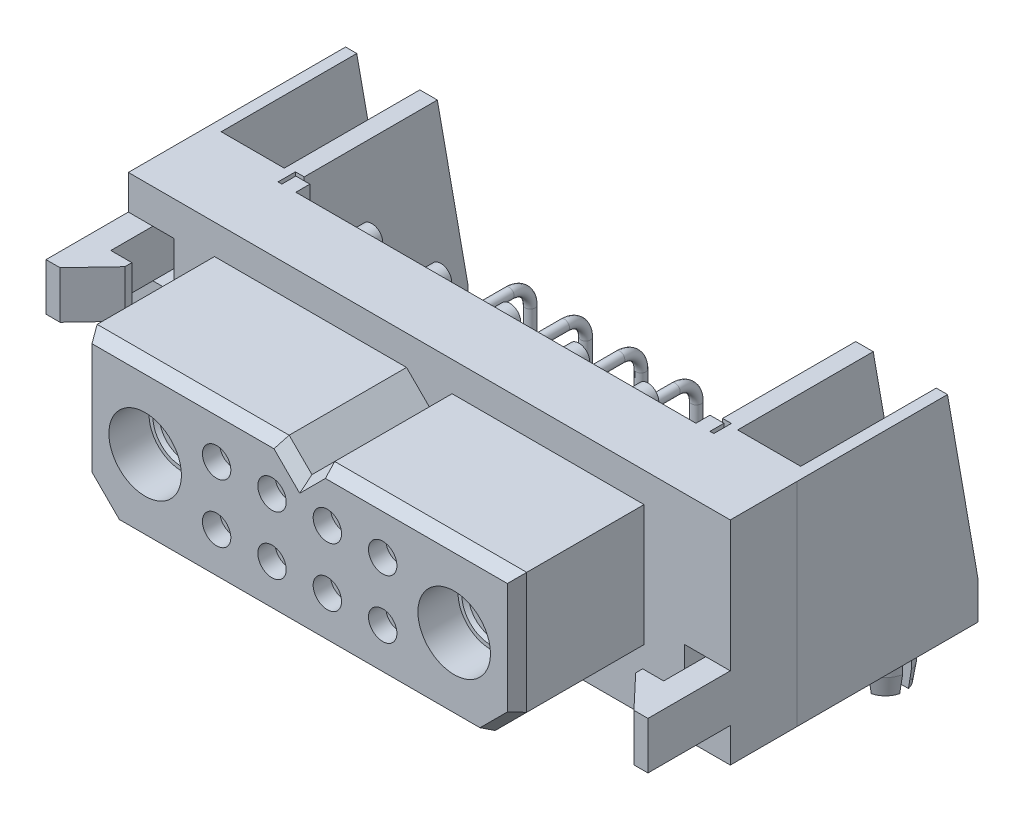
from build123d import *
from OCP.BRepFilletAPI import BRepFilletAPI_MakeChamfer

# Parameters (mm, degrees)
EXTRUDE1_DEPTH              = 15.3924
EXTRUDE2_DEPTH              = 9.398
CHAMFER1_SIZE               = 0.889
CHAMFER1_SIZE2              = 0.513264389
SKETCH4_W                   = 3.302
SKETCH4_H                   = 3.429
EXTRUDE3_DEPTH              = 5.969
SKETCH6_W                   = 1.524
SKETCH6_H                   = 3.048
CUT_EXTRUDE1_DEPTH          = 28.034538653
SKETCH7_W                   = 1.524
SKETCH7_H                   = 3.429
CUT_EXTRUDE2_DEPTH          = 4.826
SKETCH8_R                   = 0.7874
SKETCH8_W                   = 1.016
SKETCH8_H                   = 15.3924
EXTRUDE4_DEPTH              = 1.016
SKETCH9_R                   = 1.0287
CUT_EXTRUDE3_DEPTH          = 1.7272
SKETCH11_R                  = 0.89535
CUT_EXTRUDE4_DEPTH          = 1.397
LPATTERN2_COUNT             = 4
LPATTERN2_PITCH             = 4.0132
LPATTERN2_COUNT_DIR2        = 2
LPATTERN2_PITCH_DIR2        = 4.2418
CUT_EXTRUDE6_DEPTH          = 0.381
LPATTERN3_COUNT             = 4
LPATTERN3_PITCH             = 4.0132
LPATTERN3_COUNT_DIR2        = 2
LPATTERN3_PITCH_DIR2        = 4.2418
SKETCH15_R                  = 2.6289
CUT_EXTRUDE7_DEPTH          = 2.9718
EXTRUDE5_DEPTH              = 15.3923746
SKETCH18_W                  = 4.5719746
SKETCH18_H                  = 12.6745746
CUT_EXTRUDE8_DEPTH          = 12.0396
CUT_EXTRUDE9_DEPTH          = 0.508
SKETCH22_R                  = 2.6924
CUT_EXTRUDE10_DEPTH         = 0.9398
CUT_EXTRUDE11_DEPTH         = 3.4036
CUT_EXTRUDE12_DEPTH         = 44.898820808
EXTRUDE6_REACH              = 45.899
SKETCH26_W                  = 9.2964
SKETCH26_H                  = 1.524
SKETCH27_R                  = 3.175
CUT_EXTRUDE13_DEPTH         = 1.2192
SKETCH28_R                  = 2.7813
EXTRUDE7_DEPTH              = 0.4572
SKETCH29_R                  = 1.5875
CHAMFER2_SIZE               = 0.5588
LPATTERN4_COUNT             = 2
LPATTERN4_PITCH             = 22.4028
CHAMFER2_OF_LPATTERN4_SIZE  = 0.5588
SKETCH31_R                  = 0.3556
CHAMFER3_SIZE               = 0.762
CHAMFER3_SIZE2              = 0.204177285
SKETCH33_R                  = 0.3556
CHAMFER4_SIZE               = 0.762
CHAMFER4_SIZE2              = 0.204177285
LPATTERN5_COUNT             = 4
LPATTERN5_PITCH             = 4.0132
CHAMFER3_OF_LPATTERN5_SIZE2 = 0.204177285
CHAMFER3_OF_LPATTERN5_SIZE  = 0.762
CHAMFER4_OF_LPATTERN5_SIZE2 = 0.204177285
CHAMFER4_OF_LPATTERN5_SIZE  = 0.762


with BuildPart() as part:
    # Sketch2 → Extrude1 (new body)
    with BuildSketch(Plane(origin=(0, 0, 0), x_dir=(1, 0, 0), z_dir=(0, 1, 0))):
        Polygon((-21.8186, 0), (21.8186, 0), (21.8186, 4.826), (-15.5194, 4.826), (-21.8186, 4.826), align=None)
    extrude(amount=EXTRUDE1_DEPTH)

    # Sketch3 → Extrude2 (add)
    with BuildSketch(Plane.XY):
        Polygon((-13.2842, 2.159), (13.2842, 2.159), (15.5702, 4.445), (15.5702, 13.2334), (1.651, 13.2334), (0, 11.5824), (-1.651, 13.2334), (-15.5702, 13.2334), (-15.5702, 4.445), align=None)
    extrude(amount=EXTRUDE2_DEPTH)

    # Chamfer1: one chamfer whose edges measure the first distance from different faces: ONE call of the kernel's chamfer builder (chamfer() names one face for all edges)
    chamfer1_edges_1 = [part.edges().sort_by_distance(p)[0] for p in [
        (8.6106, 13.2334, 9.398),
    ]]
    chamfer1_side_1 = [part.faces().sort_by_distance(p)[0] for p in [
        (8.6106, 13.2334, 4.699),
    ]]
    chamfer1_edges_2 = [part.edges().sort_by_distance(p)[0] for p in [
        (0.8255, 12.4079, 9.398),
    ]]
    chamfer1_side_2 = [part.faces().sort_by_distance(p)[0] for p in [
        (0.8255, 12.4079, 4.699),
    ]]
    chamfer1_edges_3 = [part.edges().sort_by_distance(p)[0] for p in [
        (-0.8255, 12.4079, 9.398),
    ]]
    chamfer1_side_3 = [part.faces().sort_by_distance(p)[0] for p in [
        (-0.8255, 12.4079, 4.699),
    ]]
    chamfer1_edges_4 = [part.edges().sort_by_distance(p)[0] for p in [
        (-8.6106, 13.2334, 9.398),
    ]]
    chamfer1_side_4 = [part.faces().sort_by_distance(p)[0] for p in [
        (-8.6106, 13.2334, 4.699),
    ]]
    chamfer1_edges_5 = [part.edges().sort_by_distance(p)[0] for p in [
        (-15.5702, 8.8392, 9.398),
    ]]
    chamfer1_side_5 = [part.faces().sort_by_distance(p)[0] for p in [
        (-15.5702, 8.8392, 4.699),
    ]]
    chamfer1_edges_6 = [part.edges().sort_by_distance(p)[0] for p in [
        (-14.4272, 3.302, 9.398),
    ]]
    chamfer1_side_6 = [part.faces().sort_by_distance(p)[0] for p in [
        (-14.4272, 3.302, 4.699),
    ]]
    chamfer1_edges_7 = [part.edges().sort_by_distance(p)[0] for p in [
        (0, 2.159, 9.398),
    ]]
    chamfer1_side_7 = [part.faces().sort_by_distance(p)[0] for p in [
        (0, 2.159, 4.699),
    ]]
    chamfer1_edges_8 = [part.edges().sort_by_distance(p)[0] for p in [
        (14.4272, 3.302, 9.398),
    ]]
    chamfer1_side_8 = [part.faces().sort_by_distance(p)[0] for p in [
        (14.4272, 3.302, 4.699),
    ]]
    chamfer1_edges_9 = [part.edges().sort_by_distance(p)[0] for p in [
        (15.5702, 8.8392, 9.398),
    ]]
    chamfer1_side_9 = [part.faces().sort_by_distance(p)[0] for p in [
        (15.5702, 8.8392, 4.699),
    ]]
    chamfer1 = BRepFilletAPI_MakeChamfer(part.part.solid().wrapped)
    for e in chamfer1_edges_1:
        chamfer1.Add(CHAMFER1_SIZE, CHAMFER1_SIZE2, e.wrapped, chamfer1_side_1[0].wrapped)  # the first distance lies on this face
    for e in chamfer1_edges_2:
        chamfer1.Add(CHAMFER1_SIZE, CHAMFER1_SIZE2, e.wrapped, chamfer1_side_2[0].wrapped)  # the first distance lies on this face
    for e in chamfer1_edges_3:
        chamfer1.Add(CHAMFER1_SIZE, CHAMFER1_SIZE2, e.wrapped, chamfer1_side_3[0].wrapped)  # the first distance lies on this face
    for e in chamfer1_edges_4:
        chamfer1.Add(CHAMFER1_SIZE, CHAMFER1_SIZE2, e.wrapped, chamfer1_side_4[0].wrapped)  # the first distance lies on this face
    for e in chamfer1_edges_5:
        chamfer1.Add(CHAMFER1_SIZE, CHAMFER1_SIZE2, e.wrapped, chamfer1_side_5[0].wrapped)  # the first distance lies on this face
    for e in chamfer1_edges_6:
        chamfer1.Add(CHAMFER1_SIZE, CHAMFER1_SIZE2, e.wrapped, chamfer1_side_6[0].wrapped)  # the first distance lies on this face
    for e in chamfer1_edges_7:
        chamfer1.Add(CHAMFER1_SIZE, CHAMFER1_SIZE2, e.wrapped, chamfer1_side_7[0].wrapped)  # the first distance lies on this face
    for e in chamfer1_edges_8:
        chamfer1.Add(CHAMFER1_SIZE, CHAMFER1_SIZE2, e.wrapped, chamfer1_side_8[0].wrapped)  # the first distance lies on this face
    for e in chamfer1_edges_9:
        chamfer1.Add(CHAMFER1_SIZE, CHAMFER1_SIZE2, e.wrapped, chamfer1_side_9[0].wrapped)  # the first distance lies on this face
    add(Compound.cast(chamfer1.Shape()), mode=Mode.REPLACE)

    # Sketch4 → Extrude3 (add)
    with BuildSketch(Plane.XY):
        with Locations((-20.1676, 11.1887)):
            Rectangle(SKETCH4_W, SKETCH4_H)
        with Locations((20.1676, 4.2037)):
            Rectangle(SKETCH4_W, SKETCH4_H)
    extrude(amount=EXTRUDE3_DEPTH)

    # Sketch6 → Cut-Extrude1 (cut, through all)
    with BuildSketch(Plane(origin=(0, 12.9032, 0), x_dir=(-1, 0, 0), z_dir=(0, 1, 0))):
        Polygon((20.8026, 5.969), (18.5166, 3.556), (18.5166, 5.969), align=None)
        with Locations((19.2786, 1.524)):
            Rectangle(SKETCH6_W, SKETCH6_H)
        Polygon((-18.5166, 5.969), (-18.5166, 3.556), (-20.8026, 5.969), align=None)
        with Locations((-19.2786, 1.524)):
            Rectangle(SKETCH6_W, SKETCH6_H)
    extrude(amount=-CUT_EXTRUDE1_DEPTH, mode=Mode.SUBTRACT)

    # Sketch7 → Cut-Extrude2 (cut)
    with BuildSketch(Plane(origin=(0, 0, -4.826), x_dir=(-1, 0, 0), z_dir=(0, 0, -1))):
        with Locations((-19.2786, 4.2037)):
            Rectangle(SKETCH7_W, SKETCH7_H)
        with Locations((19.2786, 11.1887)):
            Rectangle(SKETCH7_W, SKETCH7_H)
    extrude(amount=-CUT_EXTRUDE2_DEPTH, mode=Mode.SUBTRACT)

    # Sketch8 → Extrude4 (add)
    with BuildSketch(Plane(origin=(0, 0, -4.826), x_dir=(-1, 0, 0), z_dir=(0, 0, -1))):
        with Locations(Location((-10.0076, 14.3764, 0), (0, 0, 180))):
            Circle(SKETCH8_R)
        with Locations(Location((-5.0038, 14.3764, 0), (0, 0, 180))):
            Circle(SKETCH8_R)
        with Locations(Location((0, 14.3764, 0), (0, 0, 180))):
            Circle(SKETCH8_R)
        with Locations(Location((5.0038, 14.3764, 0), (0, 0, 180))):
            Circle(SKETCH8_R)
        with Locations(Location((10.0076, 14.3764, 0), (0, 0, 180))):
            Circle(SKETCH8_R)
        with Locations(Location((10.0076, 1.016, 0), (0, 0, 180))):
            Circle(SKETCH8_R)
        with Locations(Location((5.0038, 1.016, 0), (0, 0, 180))):
            Circle(SKETCH8_R)
        with Locations(Location((0, 1.016, 0), (0, 0, 180))):
            Circle(SKETCH8_R)
        with Locations(Location((-5.0038, 1.016, 0), (0, 0, 180))):
            Circle(SKETCH8_R)
        with Locations(Location((-10.0076, 1.016, 0), (0, 0, 180))):
            Circle(SKETCH8_R)
        with Locations((-15.0114, 7.6962)):
            Rectangle(SKETCH8_W, SKETCH8_H)
        with Locations((15.0114, 7.6962)):
            Rectangle(SKETCH8_W, SKETCH8_H)
    extrude(amount=EXTRUDE4_DEPTH)

    # Sketch9 → Cut-Extrude3 (cut)
    with BuildSketch(Plane.XY.offset(9.398)):
        with Locations((6.0198, 9.8298)):
            Circle(SKETCH9_R)
        with Locations((2.0066, 9.8298)):
            Circle(SKETCH9_R)
        with Locations((-2.0066, 9.816031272)):
            Circle(SKETCH9_R)
        with Locations((-6.0198, 9.816031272)):
            Circle(SKETCH9_R)
        with Locations((6.0198, 5.588)):
            Circle(SKETCH9_R)
        with Locations((2.0066, 5.574231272)):
            Circle(SKETCH9_R)
        with Locations((-2.0066, 5.574231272)):
            Circle(SKETCH9_R)
        with Locations((-6.0198, 5.574231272)):
            Circle(SKETCH9_R)
    extrude(amount=-CUT_EXTRUDE3_DEPTH, mode=Mode.SUBTRACT)

    # Sketch11 → Cut-Extrude4 (cut)
    with BuildSketch(Plane(origin=(0, 0, -4.826), x_dir=(-1, 0, 0), z_dir=(0, 0, -1))):
        with Locations((6.0198, 9.8171)):
            Circle(SKETCH11_R)
        with Locations((2.0066, 9.8171)):
            Circle(SKETCH11_R)
        with Locations((-2.0066, 9.8171)):
            Circle(SKETCH11_R)
        with Locations((-6.0198, 9.8171)):
            Circle(SKETCH11_R)
        with Locations((6.0198, 5.5753)):
            Circle(SKETCH11_R)
        with Locations((2.0066, 5.5753)):
            Circle(SKETCH11_R)
        with Locations((-2.0066, 5.5753)):
            Circle(SKETCH11_R)
        with Locations((-6.0198, 5.5753)):
            Circle(SKETCH11_R)
    extrude(amount=-CUT_EXTRUDE4_DEPTH, mode=Mode.SUBTRACT)

    # Sketch12 → Revolve2 (revolve)
    with BuildSketch(Plane(origin=(0, 9.8171, 0), x_dir=(-1, 0, 0), z_dir=(0, 1, 0))):
        Polygon((6.0198, -3.429), (6.91515, -3.429), (6.91515, -3.803068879), (6.3754, -4.289061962), (6.0198, -4.289061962), align=None)
    revolve2 = revolve(axis=Axis((-6.0198, 9.8171, -0.619063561), (0, 0, -1)))

    # LPattern2: Revolve2 4 × 2
    with Locations(*[(i * LPATTERN2_PITCH, -j * LPATTERN2_PITCH_DIR2, 0) for i in range(LPATTERN2_COUNT) for j in range(LPATTERN2_COUNT_DIR2) if (i, j) != (0, 0)]):
        add(revolve2)

    # Sketch10 → Revolve3 (revolve)
    with BuildSketch(Plane(origin=(0, 9.8171, 0), x_dir=(-1, 0, 0), z_dir=(0, 1, 0))):
        Polygon((6.0198, 7.6708), (7.0104, 7.6708), (7.0104, 8.1788), (6.660244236, 8.1788), (6.439828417, 7.797028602), (6.0198, 7.797028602), align=None)
    revolve3 = revolve(axis=Axis((-6.0198, 9.8171, 7.6708), (0, 0, 1)))

    # Sketch14 → Cut-Extrude6 (cut)
    with BuildSketch(Plane.XY.offset(8.1788)):
        with BuildLine():
            Line((-6.998606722, 9.9695), (-5.040993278, 9.9695))
            ThreePointArc((-5.040993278, 9.9695), (-5.0292, 9.8171), (-5.040993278, 9.6647))
            Line((-5.040993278, 9.6647), (-6.998606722, 9.6647))
            ThreePointArc((-6.998606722, 9.6647), (-7.0104, 9.8171), (-6.998606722, 9.9695))
        make_face()
    cut_extrude6 = extrude(amount=-CUT_EXTRUDE6_DEPTH, mode=Mode.SUBTRACT)

    # LPattern3: Revolve3, Cut-Extrude6 4 × 2
    with Locations(*[(i * LPATTERN3_PITCH, -j * LPATTERN3_PITCH_DIR2, 0) for i in range(LPATTERN3_COUNT) for j in range(LPATTERN3_COUNT_DIR2) if (i, j) != (0, 0)]):
        add(revolve3)
        add(cut_extrude6, mode=Mode.SUBTRACT)

    # Sketch15 → Cut-Extrude7 (cut)
    with BuildSketch(Plane.XY.offset(9.398)):
        with Locations((-11.2014, 7.6962)):
            Circle(SKETCH15_R)
        with Locations(Location((11.2014, 7.6962, 0), (0, 0, 180))):
            Circle(SKETCH15_R)
    extrude(amount=-CUT_EXTRUDE7_DEPTH, mode=Mode.SUBTRACT)

    # Sketch16 → Revolve4 (revolve)
    with BuildSketch(Plane(origin=(0, 7.6962, 0), x_dir=(-1, 0, 0), z_dir=(0, 1, 0)), mode=Mode.PRIVATE) as revolve4_sk:
        Polygon((13.5636, 6.4262), (13.5636, 6.7564), (13.2842, 6.7564), (13.0429, 6.5151), (11.2014, 6.5151), (11.2014, 6.4262), align=None)
    revolve4 = revolve(revolve4_sk.sketch.rotate(Axis((-11.2014, 7.6962, 6.5151), (0, 0, -1)), 180), axis=Axis((-11.2014, 7.6962, 6.5151), (0, 0, -1)))

    # Mirror1: Revolve4 across plane
    add(revolve4.mirror(Plane(origin=(0, 0, 0), x_dir=(0, 0, 1), z_dir=(1, 0, 0))))

    # Sketch17 → Extrude5 (add)
    with BuildSketch(Plane(origin=(0, 15.3924, 0), x_dir=(1, 0, 0), z_dir=(0, 1, 0))):
        Polygon((21.8185746, 4.826), (15.7988, 4.826), (15.7988, 6.096), (15.1638, 6.096), (15.1638, 17.9578), (21.8185746, 17.9578), align=None)
    extrude5 = extrude(amount=-EXTRUDE5_DEPTH)

    # Sketch18 → Cut-Extrude8 (cut)
    with BuildSketch(Plane(origin=(0, 0, -17.9578), x_dir=(-1, 0, 0), z_dir=(0, 0, -1))):
        with Locations((-18.7197873, 9.0551127)):
            Rectangle(SKETCH18_W, SKETCH18_H)
    cut_extrude8 = extrude(amount=-CUT_EXTRUDE8_DEPTH, mode=Mode.SUBTRACT)

    # Sketch19 → Revolve5 (revolve)
    with BuildSketch(Plane(origin=(18.7198, 0, 0), x_dir=(0, 0, -1), z_dir=(1, 0, 0)), mode=Mode.PRIVATE) as revolve5_sk:
        with BuildLine():
            Line((5.9182, 7.6962254), (5.9182, 9.7282254))
            Line((5.9182, 9.7282254), (6.6802, 9.7282254))
            ThreePointArc((6.6802, 9.7282254), (7.219015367, 9.505040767), (7.4422, 8.9662254))
            Line((7.4422, 8.9662254), (7.4422, 7.6962254))
            Line((7.4422, 7.6962254), (5.9182, 7.6962254))
        make_face()
    revolve5 = revolve(revolve5_sk.sketch.rotate(Axis((18.7198, 7.6962254, -5.9182), (0, 0, -1)), 180), axis=Axis((18.7198, 7.6962254, -5.9182), (0, 0, -1)))

    # Sketch20 → Cut-Extrude9 (cut)
    with BuildSketch(Plane(origin=(0, 0, -7.4422), x_dir=(-1, 0, 0), z_dir=(0, 0, -1))):
        Polygon((-18.504756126, 7.911269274), (-18.504756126, 8.459416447), (-18.934843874, 8.459416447), (-18.934843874, 7.911269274), (-19.482991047, 7.911269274), (-19.482991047, 7.481181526), (-18.934843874, 7.481181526), (-18.934843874, 6.933034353), (-18.504756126, 6.933034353), (-18.504756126, 7.481181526), (-17.956608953, 7.481181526), (-17.956608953, 7.911269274), align=None)
    cut_extrude9 = extrude(amount=-CUT_EXTRUDE9_DEPTH, mode=Mode.SUBTRACT)

    # Sketch22 → Cut-Extrude10 (cut)
    with BuildSketch(Plane.XZ.offset(-2.54e-05)):
        with Locations(Location((18.7197746, -14.351, 0), (0, 0, 270))):
            Circle(SKETCH22_R)
    cut_extrude10 = extrude(amount=-CUT_EXTRUDE10_DEPTH, mode=Mode.SUBTRACT)

    # Sketch23 → Revolve6 (revolve)
    with BuildSketch(Plane(origin=(18.7198, 0, 0), x_dir=(0, 0, -1), z_dir=(1, 0, 0)), mode=Mode.PRIVATE) as revolve6_sk:
        Polygon((16.7259, 0.9398254), (16.7259, 2.54e-05), (15.8623, 2.54e-05), (15.8623, -0.7619746), (15.9385, -0.7619746), (15.9385, -2.1081746), (15.7353, -3.4035746), (14.351, -3.4035746), (14.351, 4.3688254), (14.9225, 4.3688254), (15.4305, 3.8608254), (15.4305, 0.9398254), align=None)
    revolve6 = revolve(revolve6_sk.sketch.rotate(Axis((18.7198, 4.3688254, -14.351), (0, -1, 0)), 180), axis=Axis((18.7198, 4.3688254, -14.351), (0, -1, 0)))

    # Sketch24 → Cut-Extrude11 (cut)
    with BuildSketch(Plane.XZ.offset(3.4035746)):
        with BuildLine():
            Line((17.164374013, -14.0335), (18.4023, -14.0335))
            Line((18.4023, -14.0335), (18.4023, -12.795574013))
            ThreePointArc((18.4023, -12.795574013), (18.7198, -12.7635), (19.0373, -12.795574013))
            Line((19.0373, -12.795574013), (19.0373, -14.0335))
            Line((19.0373, -14.0335), (20.275225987, -14.0335))
            ThreePointArc((20.275225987, -14.0335), (20.3073, -14.351), (20.275225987, -14.6685))
            Line((20.275225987, -14.6685), (19.0373, -14.6685))
            Line((19.0373, -14.6685), (19.0373, -15.906425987))
            ThreePointArc((19.0373, -15.906425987), (18.7198, -15.9385), (18.4023, -15.906425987))
            Line((18.4023, -15.906425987), (18.4023, -14.6685))
            Line((18.4023, -14.6685), (17.164374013, -14.6685))
            ThreePointArc((17.164374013, -14.6685), (17.1323, -14.351), (17.164374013, -14.0335))
        make_face()
    cut_extrude11 = extrude(amount=-CUT_EXTRUDE11_DEPTH, mode=Mode.SUBTRACT)

    # Sketch25 → Cut-Extrude12 (cut, through all)
    with BuildSketch(Plane.ZY.offset(-15.1638)):
        Polygon((-15.748, 15.3924), (-17.9578, 2.7178254), (-17.9578, 15.3924), align=None)
    cut_extrude12 = extrude(amount=-CUT_EXTRUDE12_DEPTH, mode=Mode.SUBTRACT)

    # Mirror2: Extrude5, Cut-Extrude8, Revolve5, Cut-Extrude9, Cut-Extrude10, Revolve6, Cut-Extrude11, Cut-Extrude12 across plane
    add(extrude5.mirror(Plane(origin=(0, 0, 0), x_dir=(0, 0, 1), z_dir=(1, 0, 0))))
    add(cut_extrude8.mirror(Plane(origin=(0, 0, 0), x_dir=(0, 0, 1), z_dir=(1, 0, 0))), mode=Mode.SUBTRACT)
    add(revolve5.mirror(Plane(origin=(0, 0, 0), x_dir=(0, 0, 1), z_dir=(1, 0, 0))))
    add(cut_extrude9.mirror(Plane(origin=(0, 0, 0), x_dir=(0, 0, 1), z_dir=(1, 0, 0))), mode=Mode.SUBTRACT)
    add(cut_extrude10.mirror(Plane(origin=(0, 0, 0), x_dir=(0, 0, 1), z_dir=(1, 0, 0))), mode=Mode.SUBTRACT)
    add(revolve6.mirror(Plane(origin=(0, 0, 0), x_dir=(0, 0, 1), z_dir=(1, 0, 0))))
    add(cut_extrude11.mirror(Plane(origin=(0, 0, 0), x_dir=(0, 0, 1), z_dir=(1, 0, 0))), mode=Mode.SUBTRACT)
    add(cut_extrude12.mirror(Plane(origin=(0, 0, 0), x_dir=(0, 0, 1), z_dir=(1, 0, 0))), mode=Mode.SUBTRACT)

    # Sketch26 → Extrude6 (add, up to next)
    with BuildSketch(Plane.ZY.offset(-15.1638), mode=Mode.PRIVATE) as extrude6_sk1:
        with Locations((-11.2522, 1.2700254)):
            Rectangle(SKETCH26_W, SKETCH26_H)
    extrude6_tool1 = extrude(extrude6_sk1.sketch, amount=EXTRUDE6_REACH, mode=Mode.PRIVATE) - part.part
    add(extrude6_tool1.solids().sort_by_distance((15.1638, 1.270025, -11.2522))[0])

    # Sketch27 → Cut-Extrude13 (cut)
    with BuildSketch(Plane(origin=(0, 0, -4.826), x_dir=(-1, 0, 0), z_dir=(0, 0, -1))):
        with Locations((-11.2014, 7.6962)):
            Circle(SKETCH27_R)
        with Locations((11.2014, 7.6962)):
            Circle(SKETCH27_R)
    extrude(amount=-CUT_EXTRUDE13_DEPTH, mode=Mode.SUBTRACT)

    # Sketch28 → Extrude7 (add)
    with BuildSketch(Plane(origin=(0, 0, -3.6068), x_dir=(-1, 0, 0), z_dir=(0, 0, -1))):
        with Locations((-11.2014, 7.6962)):
            Circle(SKETCH28_R)
    extrude7 = extrude(amount=EXTRUDE7_DEPTH)

    # Sweep1: sweep along a path in Sketch30
    with BuildLine(Plane(origin=(11.2014, 0, 0), x_dir=(0, 0, -1), z_dir=(1, 0, 0))) as sweep1_path:
        Line((4.064, 7.6962), (8.9408, 7.6962))
        ThreePointArc((8.9408, 7.6962), (10.557246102, 7.026646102), (11.2268, 5.4102))
        Line((11.2268, 5.4102), (11.2268, -3.7083746))
    # Sketch29 → Sweep1 (sweep)
    with BuildSketch(Plane(origin=(0, 0, -4.064), x_dir=(-1, 0, 0), z_dir=(0, 0, -1))):
        with Locations((-11.2014, 7.6962)):
            Circle(SKETCH29_R)
    sweep1 = sweep(path=sweep1_path.line)

    # Chamfer2
    chamfer2_edges = [part.edges().sort_by_distance(p)[0] for p in [
        (12.7889, -3.7083746, -11.2268),
    ]]
    chamfer(chamfer2_edges, length=CHAMFER2_SIZE)

    # LPattern4: Extrude7, Sweep1 ×2
    with Locations(*[(-i * LPATTERN4_PITCH, 0, 0) for i in range(1, LPATTERN4_COUNT)]):
        add(extrude7)
        add(sweep1)

    # Chamfer2 of LPattern4
    chamfer2_of_lpattern4_edges = [part.edges().sort_by_distance(p)[0] for p in [
        (-9.6139, -3.7083746, -11.2268),
    ]]
    chamfer(chamfer2_of_lpattern4_edges, length=CHAMFER2_OF_LPATTERN4_SIZE)

    # Sweep2: sweep along a path in Sketch32
    with BuildLine(Plane(origin=(6.0198, 0, 0), x_dir=(0, 0, -1), z_dir=(1, 0, 0))) as sweep2_path:
        Line((4.289061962, 5.5753), (8.3312, 5.5753))
        ThreePointArc((8.3312, 5.5753), (8.870015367, 5.352115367), (9.0932, 4.8133))
        Line((9.0932, 4.8133), (9.0932, -3.7084))
    # Sketch31 → Sweep2 (sweep)
    with BuildSketch(Plane(origin=(0, 0, -4.289061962), x_dir=(-1, 0, 0), z_dir=(0, 0, -1))):
        with Locations((-6.0198, 5.5753)):
            Circle(SKETCH31_R)
    sweep2 = sweep(path=sweep2_path.line)

    # Chamfer3
    chamfer3_edges = [part.edges().sort_by_distance(p)[0] for p in [
        (6.3754, -3.7084, -9.0932),
    ]]
    chamfer3_side = [part.faces().sort_by_distance(p)[0] for p in [
        (6.3754, -1.6001873, -9.0932),
    ]]
    chamfer(chamfer3_edges, length=CHAMFER3_SIZE, length2=CHAMFER3_SIZE2, reference=chamfer3_side[0])

    # Sweep3: sweep along a path in Sketch34
    with BuildLine(Plane(origin=(6.0198, 0, 0), x_dir=(0, 0, -1), z_dir=(1, 0, 0))) as sweep3_path:
        Line((4.289061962, 9.8171), (11.811, 9.8171))
        ThreePointArc((11.811, 9.8171), (12.888630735, 9.370730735), (13.335, 8.2931))
        Line((13.335, 8.2931), (13.335, -3.7084))
    # Sketch33 → Sweep3 (sweep)
    with BuildSketch(Plane(origin=(0, 0, -4.289061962), x_dir=(-1, 0, 0), z_dir=(0, 0, -1))):
        with Locations((-6.0198, 9.8171)):
            Circle(SKETCH33_R)
    sweep3 = sweep(path=sweep3_path.line)

    # Chamfer4
    chamfer4_edges = [part.edges().sort_by_distance(p)[0] for p in [
        (6.3754, -3.7084, -13.335),
    ]]
    chamfer4_side = [part.faces().sort_by_distance(p)[0] for p in [
        (6.3754, -1.6001873, -13.335),
    ]]
    chamfer(chamfer4_edges, length=CHAMFER4_SIZE, length2=CHAMFER4_SIZE2, reference=chamfer4_side[0])

    # LPattern5: Sweep2, Sweep3 ×4
    with Locations(*[(-i * LPATTERN5_PITCH, 0, 0) for i in range(1, LPATTERN5_COUNT)]):
        add(sweep2)
        add(sweep3)

    # Chamfer3 of LPattern5
    chamfer3_of_lpattern5_edges = [part.edges().sort_by_distance(p)[0] for p in [
        (2.3622, -3.7084, -9.0932),
        (-1.651, -3.7084, -9.0932),
        (-5.6642, -3.7084, -9.0932),
    ]]
    chamfer(chamfer3_of_lpattern5_edges, length=CHAMFER3_OF_LPATTERN5_SIZE, length2=CHAMFER3_OF_LPATTERN5_SIZE2)

    # Chamfer4 of LPattern5
    chamfer4_of_lpattern5_edges = [part.edges().sort_by_distance(p)[0] for p in [
        (2.3622, -3.7084, -13.335),
        (-1.651, -3.7084, -13.335),
        (-5.6642, -3.7084, -13.335),
    ]]
    chamfer(chamfer4_of_lpattern5_edges, length=CHAMFER4_OF_LPATTERN5_SIZE, length2=CHAMFER4_OF_LPATTERN5_SIZE2)


solid = part.part
